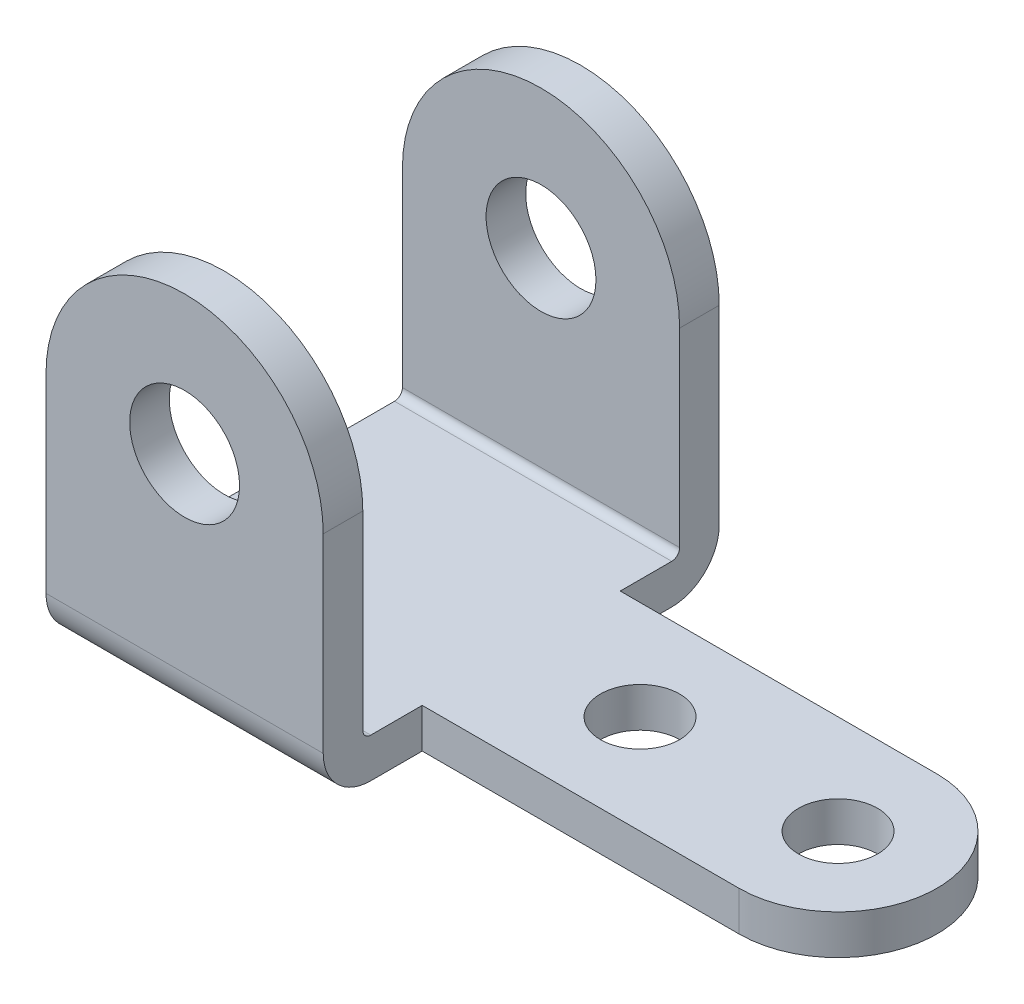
ISO-10303-21;
HEADER;
FILE_DESCRIPTION(('STEP AP214'),'2;1');
FILE_NAME('part.step','',(''),(''),'','','');
FILE_SCHEMA(('AUTOMOTIVE_DESIGN { 1 0 10303 214 1 1 1 1 }'));
ENDSEC;
DATA;
#1=APPLICATION_CONTEXT('core data for automotive mechanical design processes');
#2=APPLICATION_PROTOCOL_DEFINITION('international standard','automotive_design',2000,#1);
#3=PRODUCT_CONTEXT('',#1,'mechanical');
#4=PRODUCT('Part','Part','',(#3));
#5=PRODUCT_RELATED_PRODUCT_CATEGORY('part','',(#4));
#6=PRODUCT_DEFINITION_FORMATION('','',#4);
#7=PRODUCT_DEFINITION_CONTEXT('part definition',#1,'design');
#8=PRODUCT_DEFINITION('design','',#6,#7);
#9=PRODUCT_DEFINITION_SHAPE('','',#8);
#10=(LENGTH_UNIT() NAMED_UNIT(*) SI_UNIT(.MILLI.,.METRE.));
#11=(NAMED_UNIT(*) PLANE_ANGLE_UNIT() SI_UNIT($,.RADIAN.));
#12=(NAMED_UNIT(*) SI_UNIT($,.STERADIAN.) SOLID_ANGLE_UNIT());
#13=UNCERTAINTY_MEASURE_WITH_UNIT(LENGTH_MEASURE(1.E-05),#10,'distance_accuracy_value','');
#14=(GEOMETRIC_REPRESENTATION_CONTEXT(3) GLOBAL_UNCERTAINTY_ASSIGNED_CONTEXT((#13)) GLOBAL_UNIT_ASSIGNED_CONTEXT((#10,
#11,#12)) REPRESENTATION_CONTEXT('',''));
#15=CARTESIAN_POINT('',(0.,0.,0.));
#16=DIRECTION('',(0.,0.,1.));
#17=DIRECTION('',(1.,0.,0.));
#18=AXIS2_PLACEMENT_3D('',#15,#16,#17);
#19=CARTESIAN_POINT('',(35.,-60.,100.));
#20=DIRECTION('',(-1.,0.,0.));
#21=DIRECTION('',(0.,-1.,0.));
#22=AXIS2_PLACEMENT_3D('',#19,#20,#21);
#23=PLANE('',#22);
#24=DIRECTION('',(0.,-1.,0.));
#25=VECTOR('',#24,1.);
#26=CARTESIAN_POINT('',(35.,66.2970334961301,75.));
#27=LINE('',#26,#25);
#28=CARTESIAN_POINT('',(35.,-50.,75.));
#29=VERTEX_POINT('',#28);
#30=CARTESIAN_POINT('',(35.,-60.,75.));
#31=VERTEX_POINT('',#30);
#32=EDGE_CURVE('E169',#29,#31,#27,.T.);
#33=ORIENTED_EDGE('',*,*,#32,.F.);
#34=DIRECTION('',(0.,0.,-1.));
#35=VECTOR('',#34,1.);
#36=CARTESIAN_POINT('',(35.,-50.,100.));
#37=LINE('',#36,#35);
#38=CARTESIAN_POINT('',(35.,-50.,88.));
#39=VERTEX_POINT('',#38);
#40=EDGE_CURVE('E198',#39,#29,#37,.T.);
#41=ORIENTED_EDGE('',*,*,#40,.F.);
#42=CARTESIAN_POINT('',(35.,-48.,88.));
#43=DIRECTION('',(-1.,0.,0.));
#44=DIRECTION('',(0.,-1.,0.));
#45=AXIS2_PLACEMENT_3D('',#42,#43,#44);
#46=CIRCLE('',#45,2.);
#47=CARTESIAN_POINT('',(35.,-48.,90.));
#48=VERTEX_POINT('',#47);
#49=EDGE_CURVE('E190',#48,#39,#46,.F.);
#50=ORIENTED_EDGE('',*,*,#49,.F.);
#51=DIRECTION('',(0.,1.,0.));
#52=VECTOR('',#51,1.);
#53=CARTESIAN_POINT('',(35.,-60.,90.));
#54=LINE('',#53,#52);
#55=CARTESIAN_POINT('',(35.,0.,90.));
#56=VERTEX_POINT('',#55);
#57=EDGE_CURVE('E215',#48,#56,#54,.T.);
#58=ORIENTED_EDGE('',*,*,#57,.T.);
#59=DIRECTION('',(0.,0.,-1.));
#60=VECTOR('',#59,1.);
#61=CARTESIAN_POINT('',(35.,0.,100.));
#62=LINE('',#61,#60);
#63=CARTESIAN_POINT('',(35.,0.,100.));
#64=VERTEX_POINT('',#63);
#65=EDGE_CURVE('E238',#64,#56,#62,.T.);
#66=ORIENTED_EDGE('',*,*,#65,.F.);
#67=DIRECTION('',(0.,1.,0.));
#68=VECTOR('',#67,1.);
#69=CARTESIAN_POINT('',(35.,-60.,100.));
#70=LINE('',#69,#68);
#71=CARTESIAN_POINT('',(35.,-48.,100.));
#72=VERTEX_POINT('',#71);
#73=EDGE_CURVE('E235',#72,#64,#70,.T.);
#74=ORIENTED_EDGE('',*,*,#73,.F.);
#75=CARTESIAN_POINT('',(35.,-48.,88.));
#76=DIRECTION('',(-1.,0.,0.));
#77=DIRECTION('',(0.,-1.,0.));
#78=AXIS2_PLACEMENT_3D('',#75,#76,#77);
#79=CIRCLE('',#78,12.);
#80=CARTESIAN_POINT('',(35.,-60.,88.));
#81=VERTEX_POINT('',#80);
#82=EDGE_CURVE('E257',#72,#81,#79,.F.);
#83=ORIENTED_EDGE('',*,*,#82,.T.);
#84=DIRECTION('',(0.,0.,-1.));
#85=VECTOR('',#84,1.);
#86=CARTESIAN_POINT('',(35.,-60.,100.));
#87=LINE('',#86,#85);
#88=EDGE_CURVE('E242',#81,#31,#87,.T.);
#89=ORIENTED_EDGE('',*,*,#88,.T.);
#90=EDGE_LOOP('',(#33,#41,#50,#58,#66,#74,#83,#89));
#91=FACE_BOUND('',#90,.T.);
#92=ADVANCED_FACE('F28',(#91),#23,.F.);
#93=CARTESIAN_POINT('',(0.,0.,100.));
#94=DIRECTION('',(0.,0.,-1.));
#95=DIRECTION('',(-1.,0.,0.));
#96=AXIS2_PLACEMENT_3D('',#93,#94,#95);
#97=CYLINDRICAL_SURFACE('',#96,35.);
#98=CARTESIAN_POINT('',(0.,0.,10.));
#99=DIRECTION('',(0.,0.,1.));
#100=DIRECTION('',(1.,0.,0.));
#101=AXIS2_PLACEMENT_3D('',#98,#99,#100);
#102=CIRCLE('',#101,35.);
#103=CARTESIAN_POINT('',(35.,0.,10.));
#104=VERTEX_POINT('',#103);
#105=CARTESIAN_POINT('',(-35.,0.,10.));
#106=VERTEX_POINT('',#105);
#107=EDGE_CURVE('E183',#104,#106,#102,.T.);
#108=ORIENTED_EDGE('',*,*,#107,.F.);
#109=CARTESIAN_POINT('',(35.,0.,0.));
#110=VERTEX_POINT('',#109);
#111=EDGE_CURVE('E237',#104,#110,#62,.T.);
#112=ORIENTED_EDGE('',*,*,#111,.T.);
#113=CARTESIAN_POINT('',(0.,0.,0.));
#114=DIRECTION('',(0.,0.,1.));
#115=DIRECTION('',(1.,0.,0.));
#116=AXIS2_PLACEMENT_3D('',#113,#114,#115);
#117=CIRCLE('',#116,35.);
#118=CARTESIAN_POINT('',(-35.,0.,0.));
#119=VERTEX_POINT('',#118);
#120=EDGE_CURVE('E196',#110,#119,#117,.T.);
#121=ORIENTED_EDGE('',*,*,#120,.T.);
#122=DIRECTION('',(0.,0.,-1.));
#123=VECTOR('',#122,1.);
#124=CARTESIAN_POINT('',(-35.,0.,100.));
#125=LINE('',#124,#123);
#126=EDGE_CURVE('E248',#106,#119,#125,.T.);
#127=ORIENTED_EDGE('',*,*,#126,.F.);
#128=EDGE_LOOP('',(#108,#112,#121,#127));
#129=FACE_BOUND('',#128,.T.);
#130=ADVANCED_FACE('F340',(#129),#97,.T.);
#131=ORIENTED_EDGE('',*,*,#65,.T.);
#132=CARTESIAN_POINT('',(0.,0.,90.));
#133=DIRECTION('',(0.,0.,1.));
#134=DIRECTION('',(1.,0.,0.));
#135=AXIS2_PLACEMENT_3D('',#132,#133,#134);
#136=CIRCLE('',#135,35.);
#137=CARTESIAN_POINT('',(-35.,0.,90.));
#138=VERTEX_POINT('',#137);
#139=EDGE_CURVE('E204',#56,#138,#136,.T.);
#140=ORIENTED_EDGE('',*,*,#139,.T.);
#141=CARTESIAN_POINT('',(-35.,0.,100.));
#142=VERTEX_POINT('',#141);
#143=EDGE_CURVE('E249',#142,#138,#125,.T.);
#144=ORIENTED_EDGE('',*,*,#143,.F.);
#145=CARTESIAN_POINT('',(0.,0.,100.));
#146=DIRECTION('',(0.,0.,1.));
#147=DIRECTION('',(1.,0.,0.));
#148=AXIS2_PLACEMENT_3D('',#145,#146,#147);
#149=CIRCLE('',#148,35.);
#150=EDGE_CURVE('E229',#64,#142,#149,.T.);
#151=ORIENTED_EDGE('',*,*,#150,.F.);
#152=EDGE_LOOP('',(#131,#140,#144,#151));
#153=FACE_BOUND('',#152,.T.);
#154=ADVANCED_FACE('F30',(#153),#97,.T.);
#155=CARTESIAN_POINT('',(-35.,0.,100.));
#156=DIRECTION('',(1.,0.,0.));
#157=DIRECTION('',(0.,1.,0.));
#158=AXIS2_PLACEMENT_3D('',#155,#156,#157);
#159=PLANE('',#158);
#160=ORIENTED_EDGE('',*,*,#143,.T.);
#161=DIRECTION('',(0.,-1.,0.));
#162=VECTOR('',#161,1.);
#163=CARTESIAN_POINT('',(-35.,0.,90.));
#164=LINE('',#163,#162);
#165=CARTESIAN_POINT('',(-35.,-48.,90.));
#166=VERTEX_POINT('',#165);
#167=EDGE_CURVE('E212',#138,#166,#164,.T.);
#168=ORIENTED_EDGE('',*,*,#167,.T.);
#169=CARTESIAN_POINT('',(-35.,-48.,88.));
#170=DIRECTION('',(1.,0.,0.));
#171=DIRECTION('',(0.,1.,0.));
#172=AXIS2_PLACEMENT_3D('',#169,#170,#171);
#173=CIRCLE('',#172,2.);
#174=CARTESIAN_POINT('',(-35.,-50.,88.));
#175=VERTEX_POINT('',#174);
#176=EDGE_CURVE('E197',#175,#166,#173,.F.);
#177=ORIENTED_EDGE('',*,*,#176,.F.);
#178=DIRECTION('',(0.,0.,-1.));
#179=VECTOR('',#178,1.);
#180=CARTESIAN_POINT('',(-35.,-50.,100.));
#181=LINE('',#180,#179);
#182=CARTESIAN_POINT('',(-35.,-50.,12.));
#183=VERTEX_POINT('',#182);
#184=EDGE_CURVE('E194',#175,#183,#181,.T.);
#185=ORIENTED_EDGE('',*,*,#184,.T.);
#186=CARTESIAN_POINT('',(-35.,-48.,12.));
#187=DIRECTION('',(1.,0.,0.));
#188=DIRECTION('',(0.,1.,0.));
#189=AXIS2_PLACEMENT_3D('',#186,#187,#188);
#190=CIRCLE('',#189,2.);
#191=CARTESIAN_POINT('',(-35.,-48.,10.));
#192=VERTEX_POINT('',#191);
#193=EDGE_CURVE('E186',#192,#183,#190,.F.);
#194=ORIENTED_EDGE('',*,*,#193,.F.);
#195=DIRECTION('',(0.,-1.,0.));
#196=VECTOR('',#195,1.);
#197=CARTESIAN_POINT('',(-35.,0.,9.99999999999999));
#198=LINE('',#197,#196);
#199=EDGE_CURVE('E205',#106,#192,#198,.T.);
#200=ORIENTED_EDGE('',*,*,#199,.F.);
#201=ORIENTED_EDGE('',*,*,#126,.T.);
#202=DIRECTION('',(0.,-1.,0.));
#203=VECTOR('',#202,1.);
#204=CARTESIAN_POINT('',(-35.,0.,0.));
#205=LINE('',#204,#203);
#206=CARTESIAN_POINT('',(-35.,-48.,0.));
#207=VERTEX_POINT('',#206);
#208=EDGE_CURVE('E223',#119,#207,#205,.T.);
#209=ORIENTED_EDGE('',*,*,#208,.T.);
#210=CARTESIAN_POINT('',(-35.,-48.,12.));
#211=DIRECTION('',(1.,0.,0.));
#212=DIRECTION('',(0.,1.,0.));
#213=AXIS2_PLACEMENT_3D('',#210,#211,#212);
#214=CIRCLE('',#213,12.);
#215=CARTESIAN_POINT('',(-35.,-60.,12.));
#216=VERTEX_POINT('',#215);
#217=EDGE_CURVE('E264',#207,#216,#214,.F.);
#218=ORIENTED_EDGE('',*,*,#217,.T.);
#219=DIRECTION('',(0.,0.,-1.));
#220=VECTOR('',#219,1.);
#221=CARTESIAN_POINT('',(-35.,-60.,100.));
#222=LINE('',#221,#220);
#223=CARTESIAN_POINT('',(-35.,-60.,88.));
#224=VERTEX_POINT('',#223);
#225=EDGE_CURVE('E245',#224,#216,#222,.T.);
#226=ORIENTED_EDGE('',*,*,#225,.F.);
#227=CARTESIAN_POINT('',(-35.,-48.,88.));
#228=DIRECTION('',(1.,0.,0.));
#229=DIRECTION('',(0.,1.,0.));
#230=AXIS2_PLACEMENT_3D('',#227,#228,#229);
#231=CIRCLE('',#230,12.);
#232=CARTESIAN_POINT('',(-35.,-48.,100.));
#233=VERTEX_POINT('',#232);
#234=EDGE_CURVE('E37',#224,#233,#231,.F.);
#235=ORIENTED_EDGE('',*,*,#234,.T.);
#236=DIRECTION('',(0.,-1.,0.));
#237=VECTOR('',#236,1.);
#238=CARTESIAN_POINT('',(-35.,0.,100.));
#239=LINE('',#238,#237);
#240=EDGE_CURVE('E232',#142,#233,#239,.T.);
#241=ORIENTED_EDGE('',*,*,#240,.F.);
#242=EDGE_LOOP('',(#160,#168,#177,#185,#194,#200,#201,#209,#218,#226,#235,#241));
#243=FACE_BOUND('',#242,.T.);
#244=ADVANCED_FACE('F297',(#243),#159,.F.);
#245=CARTESIAN_POINT('',(-35.,-60.,100.));
#246=DIRECTION('',(0.,1.,0.));
#247=DIRECTION('',(0.,0.,1.));
#248=AXIS2_PLACEMENT_3D('',#245,#246,#247);
#249=PLANE('',#248);
#250=CARTESIAN_POINT('',(115.,-60.,50.));
#251=DIRECTION('',(0.,-1.,0.));
#252=DIRECTION('',(1.,0.,0.));
#253=AXIS2_PLACEMENT_3D('',#250,#251,#252);
#254=CIRCLE('',#253,10.);
#255=CARTESIAN_POINT('',(125.,-60.,50.));
#256=VERTEX_POINT('',#255);
#257=EDGE_CURVE('E277',#256,#256,#254,.T.);
#258=ORIENTED_EDGE('',*,*,#257,.F.);
#259=EDGE_LOOP('',(#258));
#260=FACE_BOUND('',#259,.T.);
#261=CARTESIAN_POINT('',(65.,-60.,50.));
#262=DIRECTION('',(0.,-1.,0.));
#263=DIRECTION('',(1.,0.,0.));
#264=AXIS2_PLACEMENT_3D('',#261,#262,#263);
#265=CIRCLE('',#264,9.99999999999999);
#266=CARTESIAN_POINT('',(75.,-60.,50.));
#267=VERTEX_POINT('',#266);
#268=EDGE_CURVE('E269',#267,#267,#265,.T.);
#269=ORIENTED_EDGE('',*,*,#268,.F.);
#270=EDGE_LOOP('',(#269));
#271=FACE_BOUND('',#270,.T.);
#272=ORIENTED_EDGE('',*,*,#88,.F.);
#273=DIRECTION('',(1.,0.,0.));
#274=VECTOR('',#273,1.);
#275=CARTESIAN_POINT('',(-35.,-60.,88.));
#276=LINE('',#275,#274);
#277=EDGE_CURVE('E262',#81,#224,#276,.F.);
#278=ORIENTED_EDGE('',*,*,#277,.T.);
#279=ORIENTED_EDGE('',*,*,#225,.T.);
#280=DIRECTION('',(1.,0.,0.));
#281=VECTOR('',#280,1.);
#282=CARTESIAN_POINT('',(-35.,-60.,12.));
#283=LINE('',#282,#281);
#284=CARTESIAN_POINT('',(35.,-60.,12.));
#285=VERTEX_POINT('',#284);
#286=EDGE_CURVE('E259',#216,#285,#283,.T.);
#287=ORIENTED_EDGE('',*,*,#286,.T.);
#288=CARTESIAN_POINT('',(35.,-60.,25.));
#289=VERTEX_POINT('',#288);
#290=EDGE_CURVE('E241',#289,#285,#87,.T.);
#291=ORIENTED_EDGE('',*,*,#290,.F.);
#292=DIRECTION('',(1.,0.,0.));
#293=VECTOR('',#292,1.);
#294=CARTESIAN_POINT('',(35.,-60.,25.));
#295=LINE('',#294,#293);
#296=CARTESIAN_POINT('',(115.,-60.,25.));
#297=VERTEX_POINT('',#296);
#298=EDGE_CURVE('E162',#289,#297,#295,.T.);
#299=ORIENTED_EDGE('',*,*,#298,.T.);
#300=CARTESIAN_POINT('',(115.,-60.,50.));
#301=DIRECTION('',(0.,-1.,0.));
#302=DIRECTION('',(1.,0.,0.));
#303=AXIS2_PLACEMENT_3D('',#300,#301,#302);
#304=CIRCLE('',#303,25.);
#305=CARTESIAN_POINT('',(115.,-60.,75.));
#306=VERTEX_POINT('',#305);
#307=EDGE_CURVE('E157',#297,#306,#304,.T.);
#308=ORIENTED_EDGE('',*,*,#307,.T.);
#309=DIRECTION('',(1.,0.,0.));
#310=VECTOR('',#309,1.);
#311=CARTESIAN_POINT('',(35.,-60.,75.));
#312=LINE('',#311,#310);
#313=EDGE_CURVE('E166',#31,#306,#312,.T.);
#314=ORIENTED_EDGE('',*,*,#313,.F.);
#315=EDGE_LOOP('',(#272,#278,#279,#287,#291,#299,#308,#314));
#316=FACE_BOUND('',#315,.T.);
#317=ADVANCED_FACE('F283',(#260,#271,#316),#249,.F.);
#318=CARTESIAN_POINT('',(35.,-50.,25.));
#319=VERTEX_POINT('',#318);
#320=CARTESIAN_POINT('',(35.,-50.,12.));
#321=VERTEX_POINT('',#320);
#322=EDGE_CURVE('E200',#319,#321,#37,.T.);
#323=ORIENTED_EDGE('',*,*,#322,.F.);
#324=DIRECTION('',(0.,-1.,0.));
#325=VECTOR('',#324,1.);
#326=CARTESIAN_POINT('',(35.,66.2970334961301,25.));
#327=LINE('',#326,#325);
#328=EDGE_CURVE('E45',#319,#289,#327,.T.);
#329=ORIENTED_EDGE('',*,*,#328,.T.);
#330=ORIENTED_EDGE('',*,*,#290,.T.);
#331=CARTESIAN_POINT('',(35.,-48.,12.));
#332=DIRECTION('',(-1.,0.,0.));
#333=DIRECTION('',(0.,-1.,0.));
#334=AXIS2_PLACEMENT_3D('',#331,#332,#333);
#335=CIRCLE('',#334,12.);
#336=CARTESIAN_POINT('',(35.,-48.,0.));
#337=VERTEX_POINT('',#336);
#338=EDGE_CURVE('E255',#285,#337,#335,.F.);
#339=ORIENTED_EDGE('',*,*,#338,.T.);
#340=DIRECTION('',(0.,1.,0.));
#341=VECTOR('',#340,1.);
#342=CARTESIAN_POINT('',(35.,-60.,0.));
#343=LINE('',#342,#341);
#344=EDGE_CURVE('E226',#337,#110,#343,.T.);
#345=ORIENTED_EDGE('',*,*,#344,.T.);
#346=ORIENTED_EDGE('',*,*,#111,.F.);
#347=DIRECTION('',(0.,1.,0.));
#348=VECTOR('',#347,1.);
#349=CARTESIAN_POINT('',(35.,-60.,9.99999999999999));
#350=LINE('',#349,#348);
#351=CARTESIAN_POINT('',(35.,-48.,10.));
#352=VERTEX_POINT('',#351);
#353=EDGE_CURVE('E202',#352,#104,#350,.T.);
#354=ORIENTED_EDGE('',*,*,#353,.F.);
#355=CARTESIAN_POINT('',(35.,-48.,12.));
#356=DIRECTION('',(-1.,0.,0.));
#357=DIRECTION('',(0.,-1.,0.));
#358=AXIS2_PLACEMENT_3D('',#355,#356,#357);
#359=CIRCLE('',#358,2.);
#360=EDGE_CURVE('E193',#321,#352,#359,.F.);
#361=ORIENTED_EDGE('',*,*,#360,.F.);
#362=EDGE_LOOP('',(#323,#329,#330,#339,#345,#346,#354,#361));
#363=FACE_BOUND('',#362,.T.);
#364=ADVANCED_FACE('F286',(#363),#23,.F.);
#365=CARTESIAN_POINT('',(0.,0.,100.));
#366=DIRECTION('',(0.,0.,1.));
#367=DIRECTION('',(1.,0.,0.));
#368=AXIS2_PLACEMENT_3D('',#365,#366,#367);
#369=PLANE('',#368);
#370=CARTESIAN_POINT('',(0.,0.,100.));
#371=DIRECTION('',(0.,0.,1.));
#372=DIRECTION('',(1.,0.,0.));
#373=AXIS2_PLACEMENT_3D('',#370,#371,#372);
#374=CIRCLE('',#373,13.8706709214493);
#375=CARTESIAN_POINT('',(13.8706709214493,0.,100.));
#376=VERTEX_POINT('',#375);
#377=EDGE_CURVE('E173',#376,#376,#374,.T.);
#378=ORIENTED_EDGE('',*,*,#377,.F.);
#379=EDGE_LOOP('',(#378));
#380=FACE_BOUND('',#379,.T.);
#381=ORIENTED_EDGE('',*,*,#240,.T.);
#382=DIRECTION('',(1.,0.,0.));
#383=VECTOR('',#382,1.);
#384=CARTESIAN_POINT('',(35.,-48.,100.));
#385=LINE('',#384,#383);
#386=EDGE_CURVE('E252',#233,#72,#385,.T.);
#387=ORIENTED_EDGE('',*,*,#386,.T.);
#388=ORIENTED_EDGE('',*,*,#73,.T.);
#389=ORIENTED_EDGE('',*,*,#150,.T.);
#390=EDGE_LOOP('',(#381,#387,#388,#389));
#391=FACE_BOUND('',#390,.T.);
#392=ADVANCED_FACE('F316',(#380,#391),#369,.T.);
#393=CARTESIAN_POINT('',(0.,0.,0.));
#394=DIRECTION('',(0.,0.,1.));
#395=DIRECTION('',(1.,0.,0.));
#396=AXIS2_PLACEMENT_3D('',#393,#394,#395);
#397=PLANE('',#396);
#398=CARTESIAN_POINT('',(0.,0.,0.));
#399=DIRECTION('',(0.,0.,1.));
#400=DIRECTION('',(1.,0.,0.));
#401=AXIS2_PLACEMENT_3D('',#398,#399,#400);
#402=CIRCLE('',#401,13.8706709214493);
#403=CARTESIAN_POINT('',(13.8706709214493,0.,0.));
#404=VERTEX_POINT('',#403);
#405=EDGE_CURVE('E176',#404,#404,#402,.T.);
#406=ORIENTED_EDGE('',*,*,#405,.T.);
#407=EDGE_LOOP('',(#406));
#408=FACE_BOUND('',#407,.T.);
#409=ORIENTED_EDGE('',*,*,#344,.F.);
#410=DIRECTION('',(1.,0.,0.));
#411=VECTOR('',#410,1.);
#412=CARTESIAN_POINT('',(0.,-48.,0.));
#413=LINE('',#412,#411);
#414=EDGE_CURVE('E11',#337,#207,#413,.F.);
#415=ORIENTED_EDGE('',*,*,#414,.T.);
#416=ORIENTED_EDGE('',*,*,#208,.F.);
#417=ORIENTED_EDGE('',*,*,#120,.F.);
#418=EDGE_LOOP('',(#409,#415,#416,#417));
#419=FACE_BOUND('',#418,.T.);
#420=ADVANCED_FACE('F354',(#408,#419),#397,.F.);
#421=CARTESIAN_POINT('',(0.,-48.,88.));
#422=DIRECTION('',(-1.,0.,0.));
#423=DIRECTION('',(0.,0.,1.));
#424=AXIS2_PLACEMENT_3D('',#421,#422,#423);
#425=CYLINDRICAL_SURFACE('',#424,12.);
#426=ORIENTED_EDGE('',*,*,#234,.F.);
#427=ORIENTED_EDGE('',*,*,#277,.F.);
#428=ORIENTED_EDGE('',*,*,#82,.F.);
#429=ORIENTED_EDGE('',*,*,#386,.F.);
#430=EDGE_LOOP('',(#426,#427,#428,#429));
#431=FACE_BOUND('',#430,.T.);
#432=ADVANCED_FACE('F313',(#431),#425,.T.);
#433=CARTESIAN_POINT('',(-35.,-48.,12.));
#434=DIRECTION('',(1.,0.,0.));
#435=DIRECTION('',(0.,0.,-1.));
#436=AXIS2_PLACEMENT_3D('',#433,#434,#435);
#437=CYLINDRICAL_SURFACE('',#436,12.);
#438=ORIENTED_EDGE('',*,*,#217,.F.);
#439=ORIENTED_EDGE('',*,*,#414,.F.);
#440=ORIENTED_EDGE('',*,*,#338,.F.);
#441=ORIENTED_EDGE('',*,*,#286,.F.);
#442=EDGE_LOOP('',(#438,#439,#440,#441));
#443=FACE_BOUND('',#442,.T.);
#444=ADVANCED_FACE('F385',(#443),#437,.T.);
#445=CARTESIAN_POINT('',(-35.,-50.,100.));
#446=DIRECTION('',(0.,1.,0.));
#447=DIRECTION('',(0.,0.,1.));
#448=AXIS2_PLACEMENT_3D('',#445,#446,#447);
#449=PLANE('',#448);
#450=CARTESIAN_POINT('',(115.,-50.,50.));
#451=DIRECTION('',(0.,1.,0.));
#452=DIRECTION('',(0.,0.,1.));
#453=AXIS2_PLACEMENT_3D('',#450,#451,#452);
#454=CIRCLE('',#453,10.);
#455=CARTESIAN_POINT('',(115.,-50.,60.));
#456=VERTEX_POINT('',#455);
#457=EDGE_CURVE('E32',#456,#456,#454,.T.);
#458=ORIENTED_EDGE('',*,*,#457,.F.);
#459=EDGE_LOOP('',(#458));
#460=FACE_BOUND('',#459,.T.);
#461=CARTESIAN_POINT('',(65.,-50.,50.));
#462=DIRECTION('',(0.,1.,0.));
#463=DIRECTION('',(0.,0.,1.));
#464=AXIS2_PLACEMENT_3D('',#461,#462,#463);
#465=CIRCLE('',#464,9.99999999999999);
#466=CARTESIAN_POINT('',(65.,-50.,60.));
#467=VERTEX_POINT('',#466);
#468=EDGE_CURVE('E167',#467,#467,#465,.T.);
#469=ORIENTED_EDGE('',*,*,#468,.F.);
#470=EDGE_LOOP('',(#469));
#471=FACE_BOUND('',#470,.T.);
#472=ORIENTED_EDGE('',*,*,#40,.T.);
#473=DIRECTION('',(1.,0.,0.));
#474=VECTOR('',#473,1.);
#475=CARTESIAN_POINT('',(35.,-50.,75.));
#476=LINE('',#475,#474);
#477=CARTESIAN_POINT('',(115.,-50.,75.));
#478=VERTEX_POINT('',#477);
#479=EDGE_CURVE('E148',#29,#478,#476,.T.);
#480=ORIENTED_EDGE('',*,*,#479,.T.);
#481=CARTESIAN_POINT('',(115.,-50.,50.));
#482=DIRECTION('',(0.,1.,0.));
#483=DIRECTION('',(0.,0.,1.));
#484=AXIS2_PLACEMENT_3D('',#481,#482,#483);
#485=CIRCLE('',#484,25.);
#486=CARTESIAN_POINT('',(115.,-50.,25.));
#487=VERTEX_POINT('',#486);
#488=EDGE_CURVE('E142',#487,#478,#485,.F.);
#489=ORIENTED_EDGE('',*,*,#488,.F.);
#490=DIRECTION('',(1.,0.,0.));
#491=VECTOR('',#490,1.);
#492=CARTESIAN_POINT('',(35.,-50.,25.));
#493=LINE('',#492,#491);
#494=EDGE_CURVE('E146',#319,#487,#493,.T.);
#495=ORIENTED_EDGE('',*,*,#494,.F.);
#496=ORIENTED_EDGE('',*,*,#322,.T.);
#497=DIRECTION('',(1.,0.,0.));
#498=VECTOR('',#497,1.);
#499=CARTESIAN_POINT('',(-35.,-50.,12.));
#500=LINE('',#499,#498);
#501=EDGE_CURVE('E187',#183,#321,#500,.T.);
#502=ORIENTED_EDGE('',*,*,#501,.F.);
#503=ORIENTED_EDGE('',*,*,#184,.F.);
#504=DIRECTION('',(1.,0.,0.));
#505=VECTOR('',#504,1.);
#506=CARTESIAN_POINT('',(-35.,-50.,88.));
#507=LINE('',#506,#505);
#508=EDGE_CURVE('E184',#39,#175,#507,.F.);
#509=ORIENTED_EDGE('',*,*,#508,.F.);
#510=EDGE_LOOP('',(#472,#480,#489,#495,#496,#502,#503,#509));
#511=FACE_BOUND('',#510,.T.);
#512=ADVANCED_FACE('F145',(#460,#471,#511),#449,.T.);
#513=CARTESIAN_POINT('',(0.,0.,90.));
#514=DIRECTION('',(0.,0.,1.));
#515=DIRECTION('',(1.,0.,0.));
#516=AXIS2_PLACEMENT_3D('',#513,#514,#515);
#517=PLANE('',#516);
#518=CARTESIAN_POINT('',(0.,0.,90.));
#519=DIRECTION('',(0.,0.,1.));
#520=DIRECTION('',(1.,0.,0.));
#521=AXIS2_PLACEMENT_3D('',#518,#519,#520);
#522=CIRCLE('',#521,13.8706709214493);
#523=CARTESIAN_POINT('',(13.8706709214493,0.,90.));
#524=VERTEX_POINT('',#523);
#525=EDGE_CURVE('E180',#524,#524,#522,.T.);
#526=ORIENTED_EDGE('',*,*,#525,.T.);
#527=EDGE_LOOP('',(#526));
#528=FACE_BOUND('',#527,.T.);
#529=ORIENTED_EDGE('',*,*,#167,.F.);
#530=ORIENTED_EDGE('',*,*,#139,.F.);
#531=ORIENTED_EDGE('',*,*,#57,.F.);
#532=DIRECTION('',(1.,0.,0.));
#533=VECTOR('',#532,1.);
#534=CARTESIAN_POINT('',(0.,-48.,90.));
#535=LINE('',#534,#533);
#536=EDGE_CURVE('E191',#166,#48,#535,.T.);
#537=ORIENTED_EDGE('',*,*,#536,.F.);
#538=EDGE_LOOP('',(#529,#530,#531,#537));
#539=FACE_BOUND('',#538,.T.);
#540=ADVANCED_FACE('F324',(#528,#539),#517,.F.);
#541=CARTESIAN_POINT('',(0.,0.,10.));
#542=DIRECTION('',(0.,0.,1.));
#543=DIRECTION('',(1.,0.,0.));
#544=AXIS2_PLACEMENT_3D('',#541,#542,#543);
#545=PLANE('',#544);
#546=CARTESIAN_POINT('',(0.,0.,10.));
#547=DIRECTION('',(0.,0.,1.));
#548=DIRECTION('',(1.,0.,0.));
#549=AXIS2_PLACEMENT_3D('',#546,#547,#548);
#550=CIRCLE('',#549,13.8706709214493);
#551=CARTESIAN_POINT('',(13.8706709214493,0.,10.));
#552=VERTEX_POINT('',#551);
#553=EDGE_CURVE('E179',#552,#552,#550,.T.);
#554=ORIENTED_EDGE('',*,*,#553,.F.);
#555=EDGE_LOOP('',(#554));
#556=FACE_BOUND('',#555,.T.);
#557=ORIENTED_EDGE('',*,*,#353,.T.);
#558=ORIENTED_EDGE('',*,*,#107,.T.);
#559=ORIENTED_EDGE('',*,*,#199,.T.);
#560=DIRECTION('',(1.,0.,0.));
#561=VECTOR('',#560,1.);
#562=CARTESIAN_POINT('',(0.,-48.,10.));
#563=LINE('',#562,#561);
#564=EDGE_CURVE('E53',#352,#192,#563,.F.);
#565=ORIENTED_EDGE('',*,*,#564,.F.);
#566=EDGE_LOOP('',(#557,#558,#559,#565));
#567=FACE_BOUND('',#566,.T.);
#568=ADVANCED_FACE('F328',(#556,#567),#545,.T.);
#569=CARTESIAN_POINT('',(0.,-48.,88.));
#570=DIRECTION('',(-1.,0.,0.));
#571=DIRECTION('',(0.,0.,1.));
#572=AXIS2_PLACEMENT_3D('',#569,#570,#571);
#573=CYLINDRICAL_SURFACE('',#572,2.);
#574=ORIENTED_EDGE('',*,*,#176,.T.);
#575=ORIENTED_EDGE('',*,*,#536,.T.);
#576=ORIENTED_EDGE('',*,*,#49,.T.);
#577=ORIENTED_EDGE('',*,*,#508,.T.);
#578=EDGE_LOOP('',(#574,#575,#576,#577));
#579=FACE_BOUND('',#578,.T.);
#580=ADVANCED_FACE('F326',(#579),#573,.F.);
#581=CARTESIAN_POINT('',(-35.,-48.,12.));
#582=DIRECTION('',(1.,0.,0.));
#583=DIRECTION('',(0.,0.,-1.));
#584=AXIS2_PLACEMENT_3D('',#581,#582,#583);
#585=CYLINDRICAL_SURFACE('',#584,2.);
#586=ORIENTED_EDGE('',*,*,#193,.T.);
#587=ORIENTED_EDGE('',*,*,#501,.T.);
#588=ORIENTED_EDGE('',*,*,#360,.T.);
#589=ORIENTED_EDGE('',*,*,#564,.T.);
#590=EDGE_LOOP('',(#586,#587,#588,#589));
#591=FACE_BOUND('',#590,.T.);
#592=ADVANCED_FACE('F293',(#591),#585,.F.);
#593=CARTESIAN_POINT('',(0.,0.,0.));
#594=DIRECTION('',(0.,0.,1.));
#595=DIRECTION('',(1.,0.,0.));
#596=AXIS2_PLACEMENT_3D('',#593,#594,#595);
#597=CYLINDRICAL_SURFACE('',#596,13.8706709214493);
#598=ORIENTED_EDGE('',*,*,#553,.T.);
#599=EDGE_LOOP('',(#598));
#600=FACE_BOUND('',#599,.T.);
#601=ORIENTED_EDGE('',*,*,#405,.F.);
#602=EDGE_LOOP('',(#601));
#603=FACE_BOUND('',#602,.T.);
#604=ADVANCED_FACE('F334',(#600,#603),#597,.F.);
#605=ORIENTED_EDGE('',*,*,#377,.T.);
#606=EDGE_LOOP('',(#605));
#607=FACE_BOUND('',#606,.T.);
#608=ORIENTED_EDGE('',*,*,#525,.F.);
#609=EDGE_LOOP('',(#608));
#610=FACE_BOUND('',#609,.T.);
#611=ADVANCED_FACE('F380',(#607,#610),#597,.F.);
#612=CARTESIAN_POINT('',(35.,66.2970334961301,25.));
#613=DIRECTION('',(0.,0.,-1.));
#614=DIRECTION('',(-1.,0.,0.));
#615=AXIS2_PLACEMENT_3D('',#612,#613,#614);
#616=PLANE('',#615);
#617=ORIENTED_EDGE('',*,*,#328,.F.);
#618=ORIENTED_EDGE('',*,*,#494,.T.);
#619=DIRECTION('',(0.,-1.,0.));
#620=VECTOR('',#619,1.);
#621=CARTESIAN_POINT('',(115.,66.2970334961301,25.));
#622=LINE('',#621,#620);
#623=EDGE_CURVE('E152',#487,#297,#622,.T.);
#624=ORIENTED_EDGE('',*,*,#623,.T.);
#625=ORIENTED_EDGE('',*,*,#298,.F.);
#626=EDGE_LOOP('',(#617,#618,#624,#625));
#627=FACE_BOUND('',#626,.T.);
#628=ADVANCED_FACE('F160',(#627),#616,.T.);
#629=CARTESIAN_POINT('',(115.,66.2970334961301,50.));
#630=DIRECTION('',(0.,-1.,0.));
#631=DIRECTION('',(1.,0.,0.));
#632=AXIS2_PLACEMENT_3D('',#629,#630,#631);
#633=CYLINDRICAL_SURFACE('',#632,25.);
#634=ORIENTED_EDGE('',*,*,#623,.F.);
#635=ORIENTED_EDGE('',*,*,#488,.T.);
#636=DIRECTION('',(0.,-1.,0.));
#637=VECTOR('',#636,1.);
#638=CARTESIAN_POINT('',(115.,66.2970334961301,75.));
#639=LINE('',#638,#637);
#640=EDGE_CURVE('E151',#478,#306,#639,.T.);
#641=ORIENTED_EDGE('',*,*,#640,.T.);
#642=ORIENTED_EDGE('',*,*,#307,.F.);
#643=EDGE_LOOP('',(#634,#635,#641,#642));
#644=FACE_BOUND('',#643,.T.);
#645=ADVANCED_FACE('F155',(#644),#633,.T.);
#646=CARTESIAN_POINT('',(35.,66.2970334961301,75.));
#647=DIRECTION('',(0.,0.,-1.));
#648=DIRECTION('',(-1.,0.,0.));
#649=AXIS2_PLACEMENT_3D('',#646,#647,#648);
#650=PLANE('',#649);
#651=ORIENTED_EDGE('',*,*,#479,.F.);
#652=ORIENTED_EDGE('',*,*,#32,.T.);
#653=ORIENTED_EDGE('',*,*,#313,.T.);
#654=ORIENTED_EDGE('',*,*,#640,.F.);
#655=EDGE_LOOP('',(#651,#652,#653,#654));
#656=FACE_BOUND('',#655,.T.);
#657=ADVANCED_FACE('F308',(#656),#650,.F.);
#658=CARTESIAN_POINT('',(65.,35.,50.));
#659=DIRECTION('',(0.,-1.,0.));
#660=DIRECTION('',(1.,0.,0.));
#661=AXIS2_PLACEMENT_3D('',#658,#659,#660);
#662=CYLINDRICAL_SURFACE('',#661,9.99999999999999);
#663=ORIENTED_EDGE('',*,*,#468,.T.);
#664=EDGE_LOOP('',(#663));
#665=FACE_BOUND('',#664,.T.);
#666=ORIENTED_EDGE('',*,*,#268,.T.);
#667=EDGE_LOOP('',(#666));
#668=FACE_BOUND('',#667,.T.);
#669=ADVANCED_FACE('F368',(#665,#668),#662,.F.);
#670=CARTESIAN_POINT('',(115.,35.,50.));
#671=DIRECTION('',(0.,-1.,0.));
#672=DIRECTION('',(1.,0.,0.));
#673=AXIS2_PLACEMENT_3D('',#670,#671,#672);
#674=CYLINDRICAL_SURFACE('',#673,10.);
#675=ORIENTED_EDGE('',*,*,#457,.T.);
#676=EDGE_LOOP('',(#675));
#677=FACE_BOUND('',#676,.T.);
#678=ORIENTED_EDGE('',*,*,#257,.T.);
#679=EDGE_LOOP('',(#678));
#680=FACE_BOUND('',#679,.T.);
#681=ADVANCED_FACE('F366',(#677,#680),#674,.F.);
#682=CLOSED_SHELL('',(#92,#130,#154,#244,#317,#364,#392,#420,#432,#444,#512,#540,#568,#580,#592,
#604,#611,#628,#645,#657,#669,#681));
#683=MANIFOLD_SOLID_BREP('B2',#682);
#684=ADVANCED_BREP_SHAPE_REPRESENTATION('',(#18,#683),#14);
#685=SHAPE_DEFINITION_REPRESENTATION(#9,#684);
ENDSEC;
END-ISO-10303-21;
